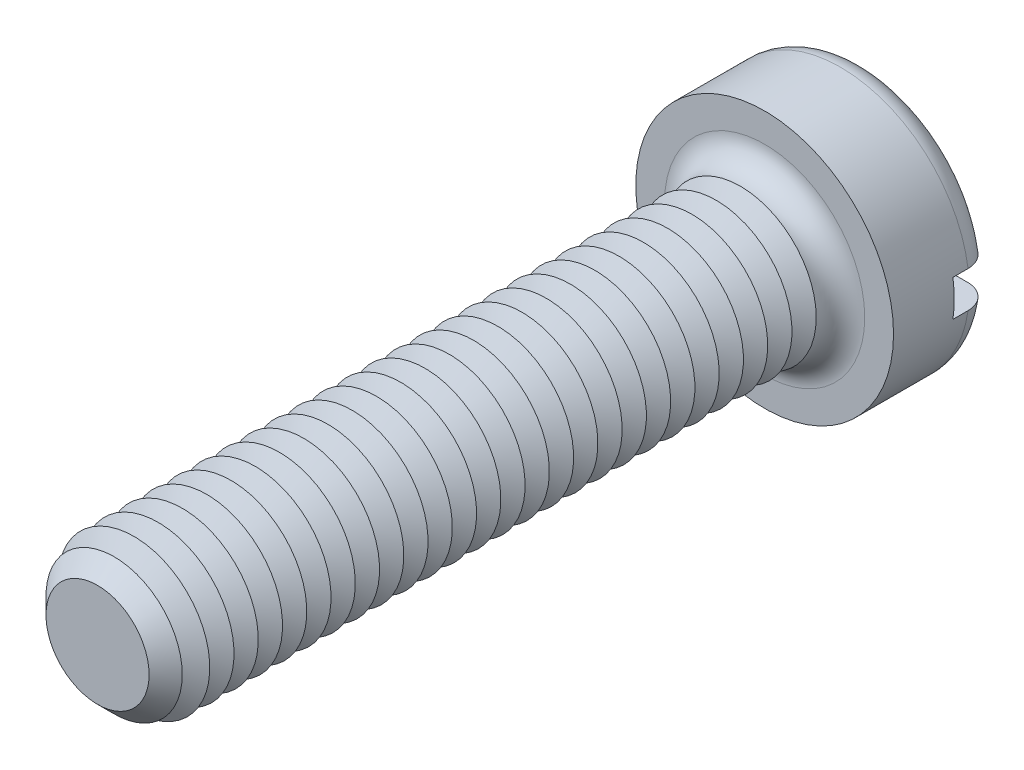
from build123d import *

# Parameters (mm, degrees)
SKETCH3_R           = 4.25
BOSS_EXTRUDE2_DEPTH = 3.3
SKETCH4_R           = 2.5
BOSS_EXTRUDE3_DEPTH = 22
FILLET1_R           = 0.8
CHAMFER1_SIZE       = 0.8
LPATTERN1_COUNT     = 27
LPATTERN1_PITCH     = 0.8
SKETCH8_W           = 8.5
SKETCH8_H           = 1.2
CUT_EXTRUDE1_DEPTH  = 1.3


with BuildPart() as part:
    # Sketch3 → Boss-Extrude2 (new body)
    with BuildSketch(Plane.XY):
        Circle(SKETCH3_R)
    extrude(amount=-BOSS_EXTRUDE2_DEPTH)

    # Sketch4 → Boss-Extrude3 (add)
    with BuildSketch(Plane.XY):
        Circle(SKETCH4_R)
    extrude(amount=BOSS_EXTRUDE3_DEPTH)

    # Fillet1
    fillet1_edges = [part.edges().sort_by_distance(p)[0] for p in [
        (-4.25, 0, -3.3),
        (-2.5, 0, 0),
    ]]
    fillet(fillet1_edges, radius=FILLET1_R)

    # Chamfer1
    chamfer1_edges = [part.edges().sort_by_distance(p)[0] for p in [
        (-2.5, 0, 22),
    ]]
    chamfer(chamfer1_edges, length=CHAMFER1_SIZE)

    # Sketch6 → Cut-Revolve1 (revolve, cut)
    with BuildSketch(Plane(origin=(0, 0, 0), x_dir=(0, 0, -1), z_dir=(1, 0, 0)), mode=Mode.PRIVATE) as cut_revolve1_sk:
        Polygon((-0.8, 2.5), (-1.2, 1.807179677), (-1.6, 2.5), align=None)
    cut_revolve1 = revolve(cut_revolve1_sk.sketch.rotate(Axis((0, 0, -1.694361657), (0, 0, 1)), 90), axis=Axis((0, 0, -1.694361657), (0, 0, 1)), mode=Mode.SUBTRACT)

    # LPattern1: Cut-Revolve1 ×27
    with Locations(*[(0, 0, i * LPATTERN1_PITCH) for i in range(1, LPATTERN1_COUNT)]):
        add(cut_revolve1, mode=Mode.SUBTRACT)

    # Sketch8 → Cut-Extrude1 (cut)
    with BuildSketch(Plane(origin=(0, 0, -3.3), x_dir=(-1, 0, 0), z_dir=(0, 0, -1))):
        Rectangle(SKETCH8_W, SKETCH8_H)
    extrude(amount=-CUT_EXTRUDE1_DEPTH, mode=Mode.SUBTRACT)


solid = part.part
